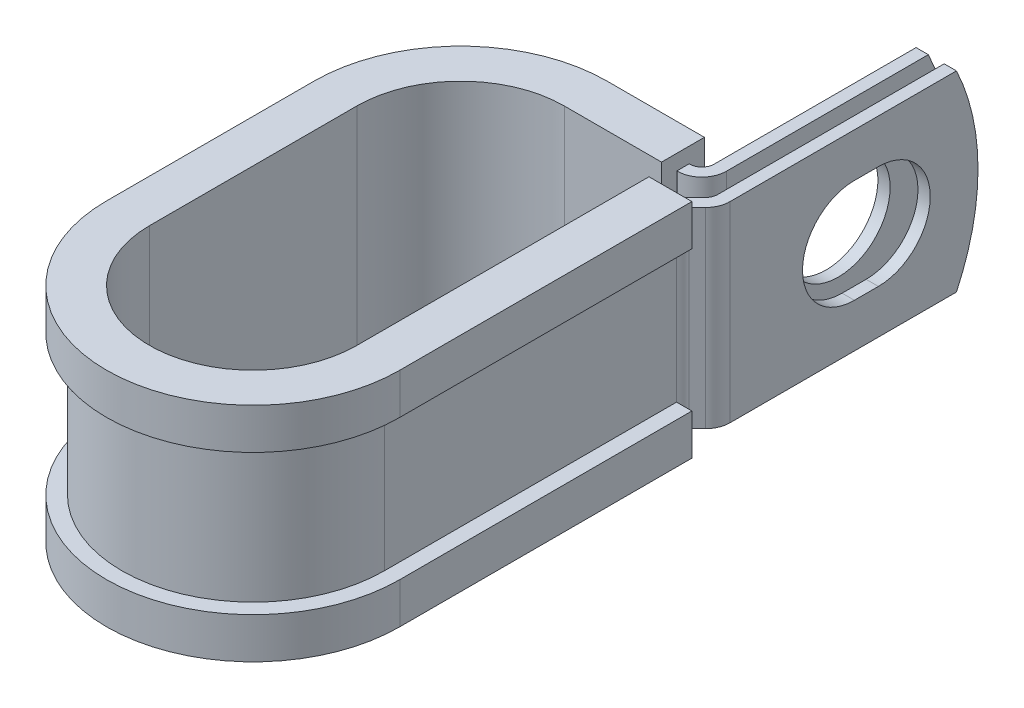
from build123d import *

# Parameters (mm, degrees)
EXTRUDE_THIN1_DEPTH = 9.525
SKETCH2_R           = 5.1562
CUT_EXTRUDE1_DEPTH  = 1.2192
CUT_EXTRUDE2_DEPTH  = 1.2192
CUT_EXTRUDE3_DEPTH  = 45.707310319


with BuildPart() as part:
    # Sketch1 → Extrude-Thin1 (new, symmetric)
    with BuildSketch(Plane(origin=(0, 0, 0), x_dir=(1, 0, 0), z_dir=(0, 1, 0))):
        with BuildLine():
            Line((13.7338698, 36.4998), (13.7338698, 11.8364))
            ThreePointArc((13.7338698, 11.8364), (13.641063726, 11.369832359), (13.376774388, 10.974295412))
            Line((13.376774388, 10.974295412), (12.550590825, 10.148111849))
            ThreePointArc((12.550590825, 10.148111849), (12.022012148, 9.357037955), (11.8364, 8.423902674))
            Line((11.8364, 8.423902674), (11.8364, 0))
            Line((11.8364, 0), (11.8364, -20.6248))
            ThreePointArc((11.8364, -20.6248), (0, -32.4612), (-11.8364, -20.6248))
            Line((-11.8364, -20.6248), (-11.8364, 0))
            ThreePointArc((-11.8364, 0), (-8.369598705, 8.369598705), (0, 11.8364))
            Line((0, 11.8364), (9.7206698, 11.8364))
            ThreePointArc((9.7206698, 11.8364), (11.444878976, 12.550590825), (12.1590698, 14.2748))
            Line((12.1590698, 14.2748), (12.1590698, 36.4998))
            Line((12.1590698, 36.4998), (10.9398698, 36.4998))
            Line((10.9398698, 36.4998), (10.9398698, 14.2748))
            ThreePointArc((10.9398698, 14.2748), (10.582774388, 13.412695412), (9.7206698, 13.0556))
            Line((9.7206698, 13.0556), (0, 13.0556))
            ThreePointArc((0, 13.0556), (-9.231703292, 9.231703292), (-13.0556, 0))
            Line((-13.0556, 0), (-13.0556, -20.6248))
            ThreePointArc((-13.0556, -20.6248), (0, -33.6804), (13.0556, -20.6248))
            Line((13.0556, -20.6248), (13.0556, 0))
            Line((13.0556, 0), (13.0556, 8.423902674))
            ThreePointArc((13.0556, 8.423902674), (13.148406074, 8.890470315), (13.412695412, 9.286007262))
            Line((13.412695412, 9.286007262), (14.238878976, 10.112190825))
            ThreePointArc((14.238878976, 10.112190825), (14.767457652, 10.903264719), (14.9530698, 11.8364))
            Line((14.9530698, 11.8364), (14.9530698, 36.4998))
            Line((14.9530698, 36.4998), (13.7338698, 36.4998))
        make_face()
    extrude(amount=EXTRUDE_THIN1_DEPTH, both=True)

    # Sketch2 → Cut-Extrude1 (cut)
    with BuildSketch(Plane.ZY.offset(-10.9398698)):
        with Locations((-25.4, 0)):
            Circle(SKETCH2_R)
    extrude(amount=-CUT_EXTRUDE1_DEPTH, mode=Mode.SUBTRACT)

    # Sketch3 → Cut-Extrude2 (cut)
    with BuildSketch(Plane(origin=(14.9530698, 0, 0), x_dir=(0, 0, -1), z_dir=(1, 0, 0))):
        with BuildLine():
            Line((24.2062, 5.1562), (26.5938, 5.1562))
            ThreePointArc((26.5938, 5.1562), (31.75, 0), (26.5938, -5.1562))
            Line((26.5938, -5.1562), (24.2062, -5.1562))
            ThreePointArc((24.2062, -5.1562), (19.05, 0), (24.2062, 5.1562))
        make_face()
    extrude(amount=-CUT_EXTRUDE2_DEPTH, mode=Mode.SUBTRACT)

    # Sketch4 → Cut-Extrude3 (cut, through all)
    with BuildSketch(Plane.ZY.offset(-10.9398698)):
        with BuildLine():
            Line((-34.355263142, 9.525), (-36.4998, 9.525))
            Line((-36.4998, 9.525), (-36.4998, -2.73e-07))
            ThreePointArc((-36.4998, -2.73e-07), (-35.957038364, 4.881717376), (-34.355263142, 9.525))
        make_face()
        with BuildLine():
            ThreePointArc((-34.355263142, -9.525), (-35.957038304, -4.881717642), (-36.4998, -2.73e-07))
            Line((-36.4998, -2.73e-07), (-36.4998, -9.525))
            Line((-36.4998, -9.525), (-34.355263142, -9.525))
        make_face()
    extrude(amount=-CUT_EXTRUDE3_DEPTH, mode=Mode.SUBTRACT)

    # Sweep1: sweep along a path in Sketch6
    with BuildLine(Plane(origin=(0, 9.525, 0), x_dir=(1, 0, 0), z_dir=(0, 1, 0))) as sweep1_path:
        Line((10.3124, 8.423902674), (10.3124, 0))
        Line((10.3124, 0), (10.3124, -20.6248))
        ThreePointArc((10.3124, -20.6248), (0, -30.9372), (-10.3124, -20.6248))
        Line((-10.3124, -20.6248), (-10.3124, 0))
        ThreePointArc((-10.3124, 0), (-7.29196797, 7.29196797), (0, 10.3124))
        Line((0, 10.3124), (9.6698698, 10.3124))
    # Sketch5 → Sweep1 (sweep)
    with BuildSketch(Plane(origin=(0, 0, -8.423902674), x_dir=(-1, 0, 0), z_dir=(0, 0, -1))):
        Polygon((-13.0556, 9.525), (-11.8364, 9.525), (-11.8364, -9.525), (-13.0556, -9.525), (-13.0556, -6.985), (-14.5796, -6.985), (-14.5796, -11.049), (-10.3124, -11.049), (-10.3124, 11.049), (-14.5796, 11.049), (-14.5796, 6.985), (-13.0556, 6.985), align=None)
    sweep(path=sweep1_path.line)


solid = part.part
